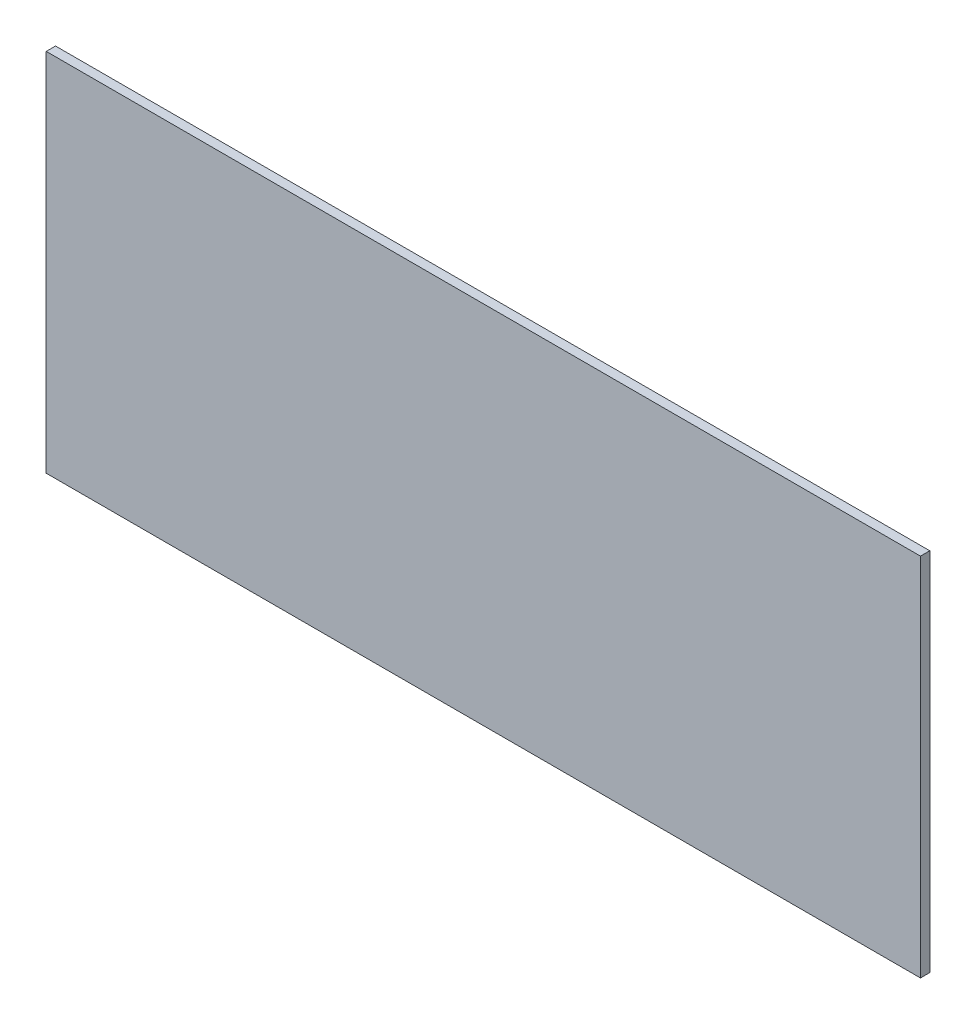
from build123d import *

# Parameters (mm, degrees)
SKETCH1_W           = 298.3125
SKETCH1_H           = 124.661472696
BOSS_EXTRUDE1_DEPTH = 3.175


with BuildPart() as part:
    # Sketch1 → Boss-Extrude1 (new body)
    with BuildSketch(Plane(origin=(0, 0, 702.615752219), x_dir=(-1, 0, 0), z_dir=(0, 0, -1))):
        with Locations((759.871620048, 339.881386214)):
            Rectangle(SKETCH1_W, SKETCH1_H)
    extrude(amount=-BOSS_EXTRUDE1_DEPTH)


solid = part.part
